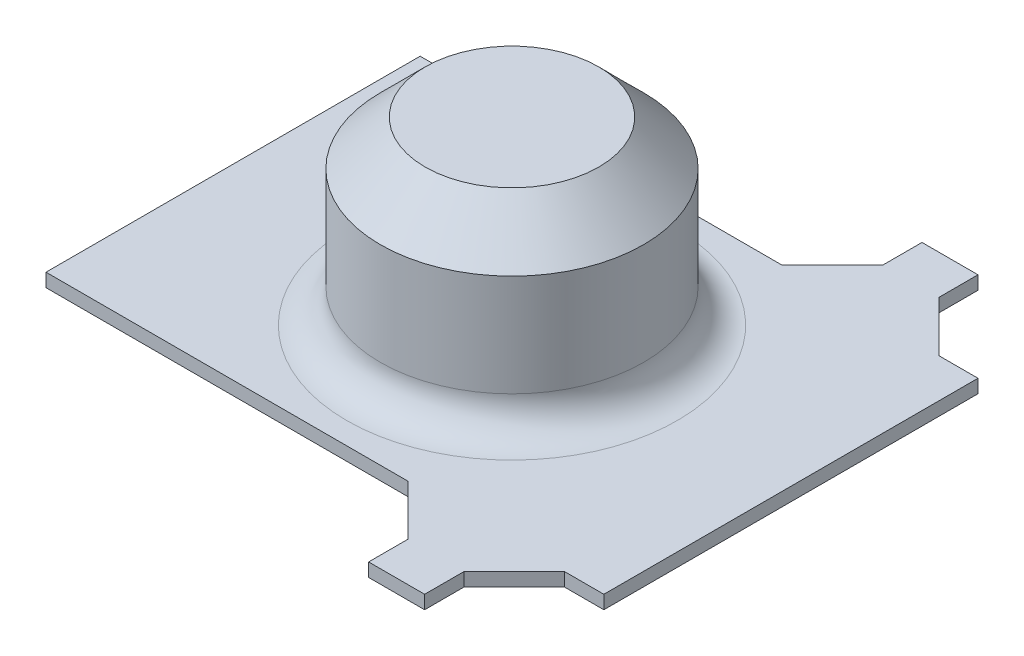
from build123d import *

# Parameters (mm, degrees)
SKETCH1_W           = 49.8
SKETCH1_H           = 33.4
SKETCH1_R           = 11.75
BOSS_EXTRUDE1_DEPTH = 1.2
SKETCH1_3_R         = 11.75
BOSS_EXTRUDE2_DEPTH = 17.3
CHAMFER2_SIZE       = 4
FILLET2_R           = 3


with BuildPart() as part:
    # Sketch1 → Boss-Extrude1 (new body)
    # profile 1 of 3: a face of its own
    with BuildSketch(Plane(origin=(0, 0, 0), x_dir=(1, 0, 0), z_dir=(0, 1, 0))):
        Polygon((7.402800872, 16.7), (21.397199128, 16.7), (16.9, 21.197199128), (16.9, 24.7), (11.9, 24.7), (11.9, 21.197199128), align=None)
    # profile 2 of 3: a face of its own
    with BuildSketch(Plane(origin=(0, 0, 0), x_dir=(1, 0, 0), z_dir=(0, 1, 0))):
        Rectangle(SKETCH1_W, SKETCH1_H)
        with Locations(Location((0, 0, 0), (0, 0, 270))):
            Circle(SKETCH1_R, mode=Mode.SUBTRACT)
    # profile 3 of 3: a face of its own
    with BuildSketch(Plane(origin=(0, 0, 0), x_dir=(1, 0, 0), z_dir=(0, 1, 0))):
        Polygon((16.9, -21.197199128), (21.397199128, -16.7), (7.402800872, -16.7), (11.9, -21.197199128), (11.9, -24.7), (16.9, -24.7), align=None)
    extrude(amount=BOSS_EXTRUDE1_DEPTH)

    # Sketch1_3 → Boss-Extrude2 (add)
    with BuildSketch(Plane(origin=(0, 0, 0), x_dir=(1, 0, 0), z_dir=(0, 1, 0))):
        with Locations(Location((0, 0, 0), (0, 0, 270))):
            Circle(SKETCH1_3_R)
    extrude(amount=BOSS_EXTRUDE2_DEPTH)

    # Chamfer2
    chamfer2_edges = [part.edges().sort_by_distance(p)[0] for p in [
        (0, 17.3, -11.75),
    ]]
    chamfer(chamfer2_edges, length=CHAMFER2_SIZE)

    # Fillet2
    fillet2_edges = [part.edges().sort_by_distance(p)[0] for p in [
        (0, 1.2, -11.75),
    ]]
    fillet(fillet2_edges, radius=FILLET2_R)


solid = part.part
